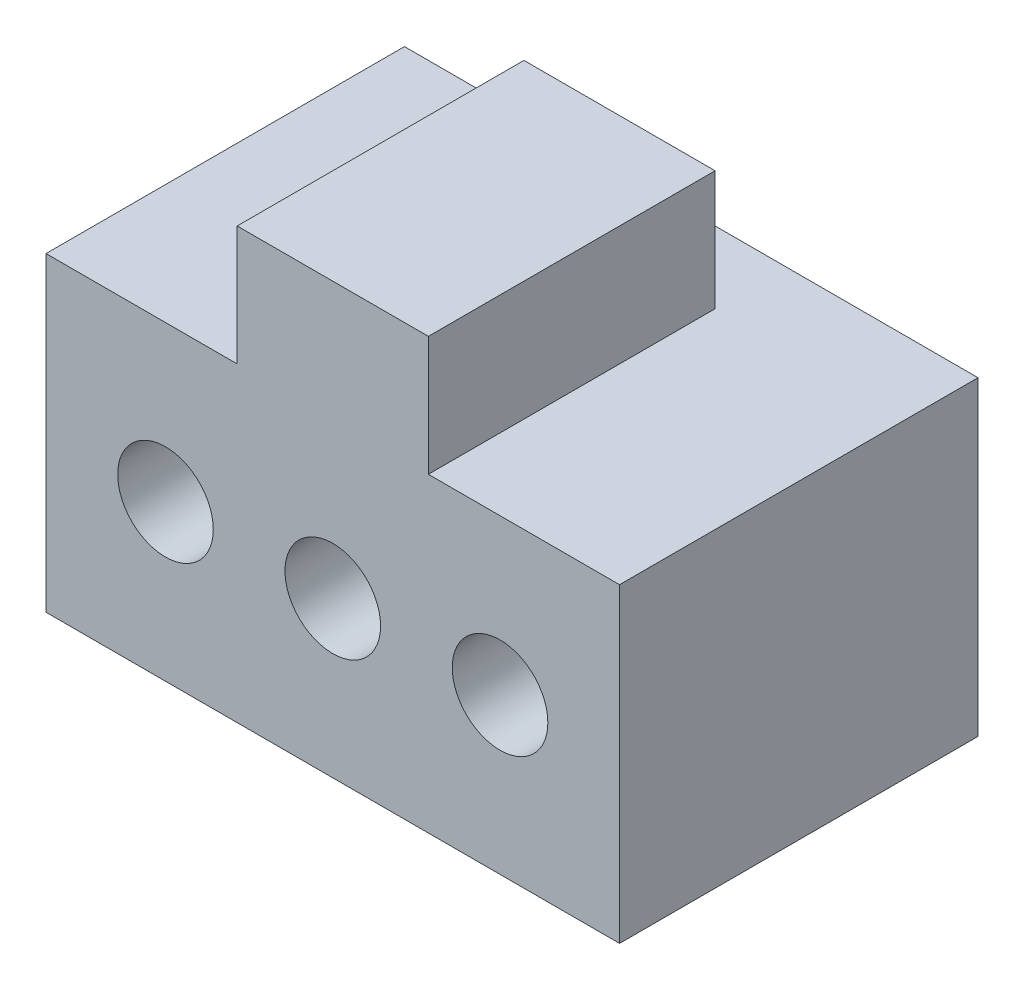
from build123d import *

# Parameters (mm, degrees)
SKETCH_1_W          = 120
SKETCH_1_H          = 65
EXTRUDE_1_DEPTH     = 75
SKETCH_2_W          = 40
SKETCH_2_H          = 25
EXTRUDE_2_DEPTH     = 60
SKETCH_3_R          = 10
CUT_EXTRUDE_1_DEPTH = 112.943065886


with BuildPart() as part:
    # Sketch 1 → Extrude 1 (new body)
    with BuildSketch(Plane.XY):
        Rectangle(SKETCH_1_W, SKETCH_1_H)
    extrude(amount=-EXTRUDE_1_DEPTH)

    # Sketch 2 → Extrude 2 (add)
    with BuildSketch(Plane.XY):
        with Locations((0, 45)):
            Rectangle(SKETCH_2_W, SKETCH_2_H)
    extrude(amount=-EXTRUDE_2_DEPTH)

    # Sketch 3 → Cut-Extrude 1 (cut, through all)
    with BuildSketch(Plane.XY):
        Circle(SKETCH_3_R)
        with Locations((35, 0)):
            Circle(SKETCH_3_R)
        with Locations((-35, 0)):
            Circle(SKETCH_3_R)
    extrude(amount=-CUT_EXTRUDE_1_DEPTH, mode=Mode.SUBTRACT)


solid = part.part
